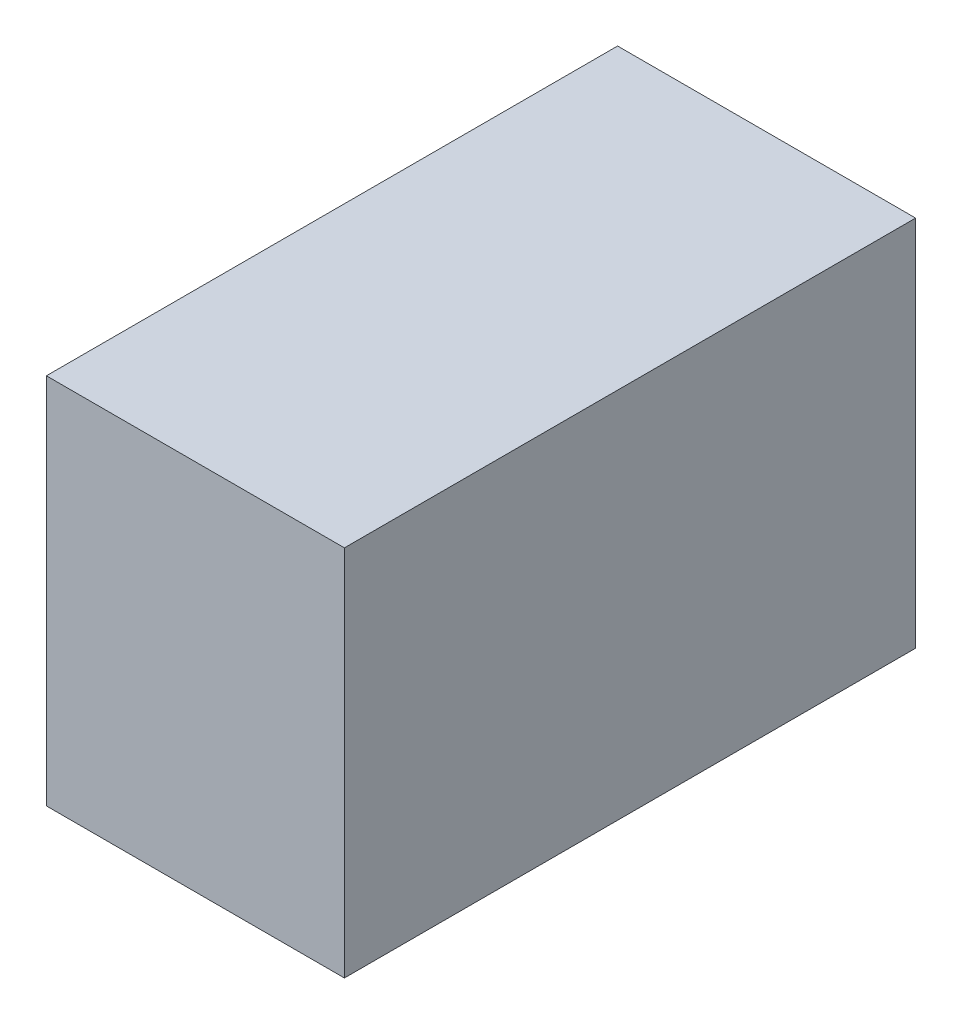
from build123d import *

# Parameters (mm, degrees)
SKETCH1_W           = 60
SKETCH1_H           = 115
BOSS_EXTRUDE1_DEPTH = 37.5


with BuildPart() as part:
    # Sketch1 → Boss-Extrude1 (new, symmetric)
    with BuildSketch(Plane(origin=(0, 0, 0), x_dir=(1, 0, 0), z_dir=(0, 1, 0))):
        Rectangle(SKETCH1_W, SKETCH1_H)
    extrude(amount=BOSS_EXTRUDE1_DEPTH, both=True)


solid = part.part
